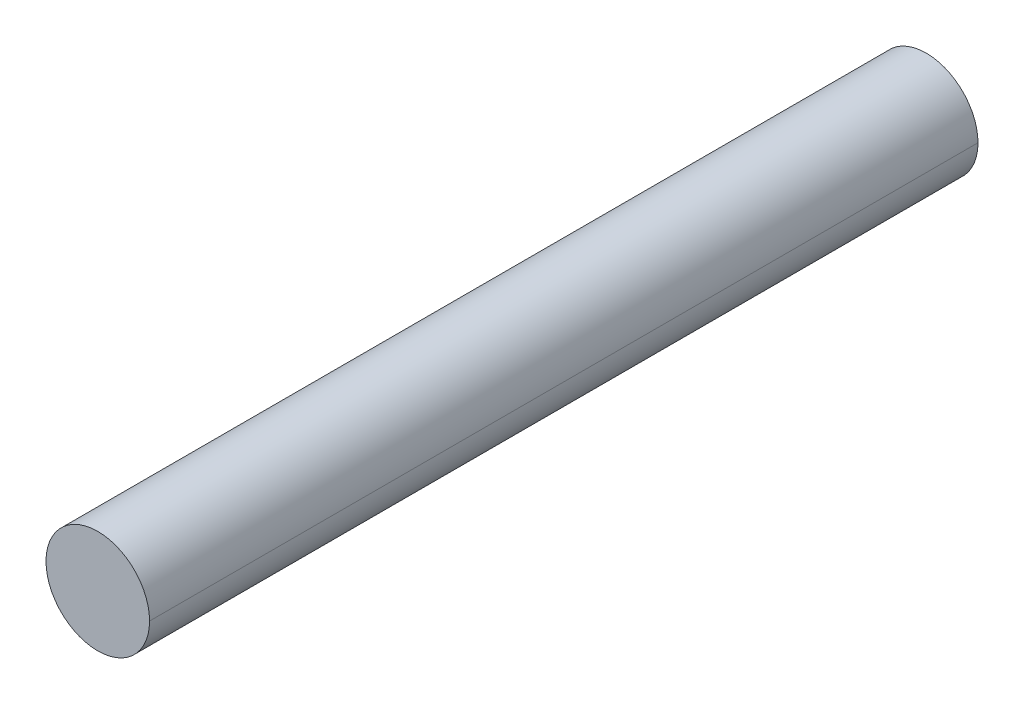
ISO-10303-21;
HEADER;
FILE_DESCRIPTION(('STEP AP214'),'2;1');
FILE_NAME('part.step','',(''),(''),'','','');
FILE_SCHEMA(('AUTOMOTIVE_DESIGN { 1 0 10303 214 1 1 1 1 }'));
ENDSEC;
DATA;
#1=APPLICATION_CONTEXT('core data for automotive mechanical design processes');
#2=APPLICATION_PROTOCOL_DEFINITION('international standard','automotive_design',2000,#1);
#3=PRODUCT_CONTEXT('',#1,'mechanical');
#4=PRODUCT('Part','Part','',(#3));
#5=PRODUCT_RELATED_PRODUCT_CATEGORY('part','',(#4));
#6=PRODUCT_DEFINITION_FORMATION('','',#4);
#7=PRODUCT_DEFINITION_CONTEXT('part definition',#1,'design');
#8=PRODUCT_DEFINITION('design','',#6,#7);
#9=PRODUCT_DEFINITION_SHAPE('','',#8);
#10=(LENGTH_UNIT() NAMED_UNIT(*) SI_UNIT(.MILLI.,.METRE.));
#11=(NAMED_UNIT(*) PLANE_ANGLE_UNIT() SI_UNIT($,.RADIAN.));
#12=(NAMED_UNIT(*) SI_UNIT($,.STERADIAN.) SOLID_ANGLE_UNIT());
#13=UNCERTAINTY_MEASURE_WITH_UNIT(LENGTH_MEASURE(1.E-05),#10,'distance_accuracy_value','');
#14=(GEOMETRIC_REPRESENTATION_CONTEXT(3) GLOBAL_UNCERTAINTY_ASSIGNED_CONTEXT((#13)) GLOBAL_UNIT_ASSIGNED_CONTEXT((#10,
#11,#12)) REPRESENTATION_CONTEXT('',''));
#15=CARTESIAN_POINT('',(0.,0.,0.));
#16=DIRECTION('',(0.,0.,1.));
#17=DIRECTION('',(1.,0.,0.));
#18=AXIS2_PLACEMENT_3D('',#15,#16,#17);
#19=CARTESIAN_POINT('',(0.,0.,152.4));
#20=DIRECTION('',(0.,0.,-1.));
#21=DIRECTION('',(-1.,0.,0.));
#22=AXIS2_PLACEMENT_3D('',#19,#20,#21);
#23=PLANE('',#22);
#24=CARTESIAN_POINT('',(0.,0.,152.4));
#25=DIRECTION('',(0.,0.,1.));
#26=DIRECTION('',(1.,0.,0.));
#27=AXIS2_PLACEMENT_3D('',#24,#25,#26);
#28=CIRCLE('',#27,19.05);
#29=CARTESIAN_POINT('',(-19.05,0.,152.4));
#30=VERTEX_POINT('',#29);
#31=CARTESIAN_POINT('',(19.05,0.,152.4));
#32=VERTEX_POINT('',#31);
#33=EDGE_CURVE('E19',#30,#32,#28,.F.);
#34=ORIENTED_EDGE('',*,*,#33,.F.);
#35=CARTESIAN_POINT('',(0.,0.,152.4));
#36=DIRECTION('',(0.,0.,1.));
#37=DIRECTION('',(1.,0.,0.));
#38=AXIS2_PLACEMENT_3D('',#35,#36,#37);
#39=CIRCLE('',#38,19.05);
#40=EDGE_CURVE('E47',#32,#30,#39,.F.);
#41=ORIENTED_EDGE('',*,*,#40,.F.);
#42=EDGE_LOOP('',(#34,#41));
#43=FACE_BOUND('',#42,.T.);
#44=ADVANCED_FACE('F16',(#43),#23,.F.);
#45=CARTESIAN_POINT('',(0.,0.,-152.4));
#46=DIRECTION('',(0.,0.,1.));
#47=DIRECTION('',(1.,0.,0.));
#48=AXIS2_PLACEMENT_3D('',#45,#46,#47);
#49=CYLINDRICAL_SURFACE('',#48,19.05);
#50=DIRECTION('',(0.,0.,1.));
#51=VECTOR('',#50,1.);
#52=CARTESIAN_POINT('',(-19.05,0.,-152.4));
#53=LINE('',#52,#51);
#54=CARTESIAN_POINT('',(-19.05,0.,-152.4));
#55=VERTEX_POINT('',#54);
#56=EDGE_CURVE('E25',#30,#55,#53,.F.);
#57=ORIENTED_EDGE('',*,*,#56,.F.);
#58=ORIENTED_EDGE('',*,*,#33,.T.);
#59=DIRECTION('',(0.,0.,1.));
#60=VECTOR('',#59,1.);
#61=CARTESIAN_POINT('',(19.05,0.,-152.4));
#62=LINE('',#61,#60);
#63=CARTESIAN_POINT('',(19.05,0.,-152.4));
#64=VERTEX_POINT('',#63);
#65=EDGE_CURVE('E41',#64,#32,#62,.T.);
#66=ORIENTED_EDGE('',*,*,#65,.F.);
#67=CARTESIAN_POINT('',(0.,0.,-152.4));
#68=DIRECTION('',(0.,0.,1.));
#69=DIRECTION('',(1.,0.,0.));
#70=AXIS2_PLACEMENT_3D('',#67,#68,#69);
#71=CIRCLE('',#70,19.05);
#72=EDGE_CURVE('E34',#64,#55,#71,.T.);
#73=ORIENTED_EDGE('',*,*,#72,.T.);
#74=EDGE_LOOP('',(#57,#58,#66,#73));
#75=FACE_BOUND('',#74,.T.);
#76=ADVANCED_FACE('F43',(#75),#49,.T.);
#77=CARTESIAN_POINT('',(0.,0.,-152.4));
#78=DIRECTION('',(0.,0.,1.));
#79=DIRECTION('',(1.,0.,0.));
#80=AXIS2_PLACEMENT_3D('',#77,#78,#79);
#81=PLANE('',#80);
#82=CARTESIAN_POINT('',(0.,0.,-152.4));
#83=DIRECTION('',(0.,0.,1.));
#84=DIRECTION('',(1.,0.,0.));
#85=AXIS2_PLACEMENT_3D('',#82,#83,#84);
#86=CIRCLE('',#85,19.05);
#87=EDGE_CURVE('E11',#55,#64,#86,.T.);
#88=ORIENTED_EDGE('',*,*,#87,.F.);
#89=ORIENTED_EDGE('',*,*,#72,.F.);
#90=EDGE_LOOP('',(#88,#89));
#91=FACE_BOUND('',#90,.T.);
#92=ADVANCED_FACE('F54',(#91),#81,.F.);
#93=CARTESIAN_POINT('',(0.,0.,-152.4));
#94=DIRECTION('',(0.,0.,1.));
#95=DIRECTION('',(1.,0.,0.));
#96=AXIS2_PLACEMENT_3D('',#93,#94,#95);
#97=CYLINDRICAL_SURFACE('',#96,19.05);
#98=ORIENTED_EDGE('',*,*,#56,.T.);
#99=ORIENTED_EDGE('',*,*,#87,.T.);
#100=ORIENTED_EDGE('',*,*,#65,.T.);
#101=ORIENTED_EDGE('',*,*,#40,.T.);
#102=EDGE_LOOP('',(#98,#99,#100,#101));
#103=FACE_BOUND('',#102,.T.);
#104=ADVANCED_FACE('F50',(#103),#97,.T.);
#105=CLOSED_SHELL('',(#44,#76,#92,#104));
#106=MANIFOLD_SOLID_BREP('B1',#105);
#107=ADVANCED_BREP_SHAPE_REPRESENTATION('',(#18,#106),#14);
#108=SHAPE_DEFINITION_REPRESENTATION(#9,#107);
ENDSEC;
END-ISO-10303-21;
